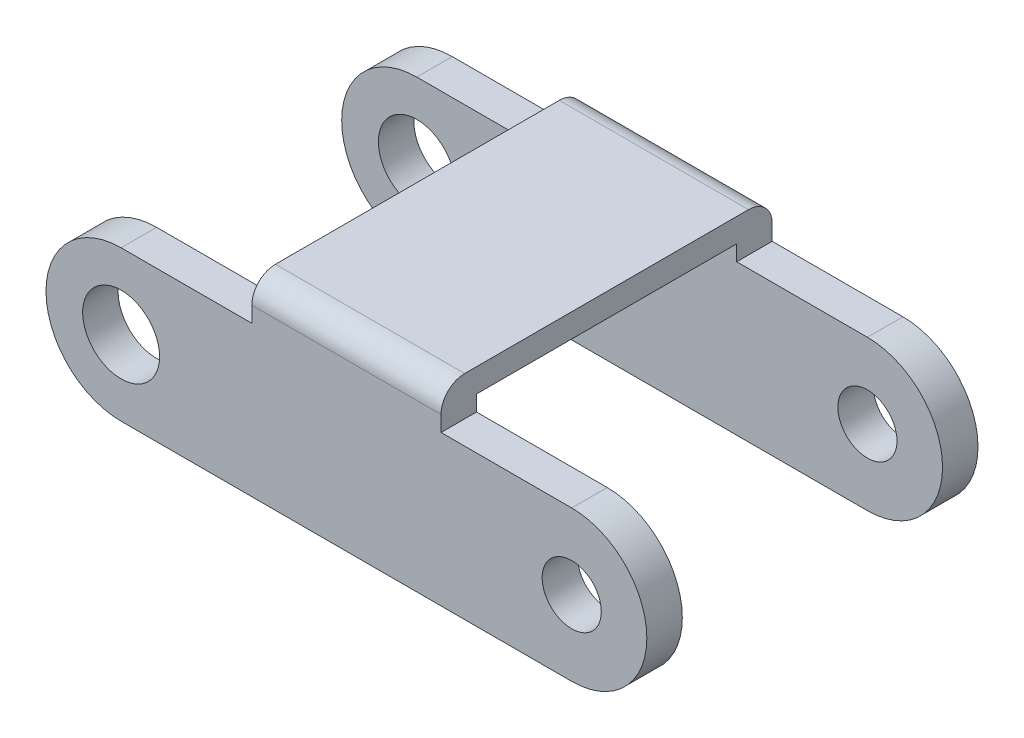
ISO-10303-21;
HEADER;
FILE_DESCRIPTION(('STEP AP214'),'2;1');
FILE_NAME('part.step','',(''),(''),'','','');
FILE_SCHEMA(('AUTOMOTIVE_DESIGN { 1 0 10303 214 1 1 1 1 }'));
ENDSEC;
DATA;
#1=APPLICATION_CONTEXT('core data for automotive mechanical design processes');
#2=APPLICATION_PROTOCOL_DEFINITION('international standard','automotive_design',2000,#1);
#3=PRODUCT_CONTEXT('',#1,'mechanical');
#4=PRODUCT('Part','Part','',(#3));
#5=PRODUCT_RELATED_PRODUCT_CATEGORY('part','',(#4));
#6=PRODUCT_DEFINITION_FORMATION('','',#4);
#7=PRODUCT_DEFINITION_CONTEXT('part definition',#1,'design');
#8=PRODUCT_DEFINITION('design','',#6,#7);
#9=PRODUCT_DEFINITION_SHAPE('','',#8);
#10=(LENGTH_UNIT() NAMED_UNIT(*) SI_UNIT(.MILLI.,.METRE.));
#11=(NAMED_UNIT(*) PLANE_ANGLE_UNIT() SI_UNIT($,.RADIAN.));
#12=(NAMED_UNIT(*) SI_UNIT($,.STERADIAN.) SOLID_ANGLE_UNIT());
#13=UNCERTAINTY_MEASURE_WITH_UNIT(LENGTH_MEASURE(1.E-05),#10,'distance_accuracy_value','');
#14=(GEOMETRIC_REPRESENTATION_CONTEXT(3) GLOBAL_UNCERTAINTY_ASSIGNED_CONTEXT((#13)) GLOBAL_UNIT_ASSIGNED_CONTEXT((#10,
#11,#12)) REPRESENTATION_CONTEXT('',''));
#15=CARTESIAN_POINT('',(0.,0.,0.));
#16=DIRECTION('',(0.,0.,1.));
#17=DIRECTION('',(1.,0.,0.));
#18=AXIS2_PLACEMENT_3D('',#15,#16,#17);
#19=CARTESIAN_POINT('',(-19.05,8.56225806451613,-3.));
#20=DIRECTION('',(0.,1.,0.));
#21=DIRECTION('',(0.,0.,1.));
#22=AXIS2_PLACEMENT_3D('',#19,#20,#21);
#23=PLANE('',#22);
#24=DIRECTION('',(-1.,0.,0.));
#25=VECTOR('',#24,1.);
#26=CARTESIAN_POINT('',(-19.05,8.56225806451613,-3.));
#27=LINE('',#26,#25);
#28=CARTESIAN_POINT('',(19.05,8.56225806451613,-3.));
#29=VERTEX_POINT('',#28);
#30=CARTESIAN_POINT('',(8.,8.56225806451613,-3.));
#31=VERTEX_POINT('',#30);
#32=EDGE_CURVE('E304',#29,#31,#27,.T.);
#33=ORIENTED_EDGE('',*,*,#32,.T.);
#34=DIRECTION('',(0.,0.,-1.));
#35=VECTOR('',#34,1.);
#36=CARTESIAN_POINT('',(8.,8.56225806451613,0.));
#37=LINE('',#36,#35);
#38=CARTESIAN_POINT('',(8.,8.56225806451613,0.));
#39=VERTEX_POINT('',#38);
#40=EDGE_CURVE('E249',#39,#31,#37,.T.);
#41=ORIENTED_EDGE('',*,*,#40,.F.);
#42=DIRECTION('',(-1.,0.,0.));
#43=VECTOR('',#42,1.);
#44=CARTESIAN_POINT('',(-19.05,8.56225806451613,0.));
#45=LINE('',#44,#43);
#46=CARTESIAN_POINT('',(19.05,8.56225806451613,0.));
#47=VERTEX_POINT('',#46);
#48=EDGE_CURVE('E299',#47,#39,#45,.T.);
#49=ORIENTED_EDGE('',*,*,#48,.F.);
#50=DIRECTION('',(0.,0.,1.));
#51=VECTOR('',#50,1.);
#52=CARTESIAN_POINT('',(19.05,8.56225806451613,-3.));
#53=LINE('',#52,#51);
#54=EDGE_CURVE('E41',#29,#47,#53,.T.);
#55=ORIENTED_EDGE('',*,*,#54,.F.);
#56=EDGE_LOOP('',(#33,#41,#49,#55));
#57=FACE_BOUND('',#56,.T.);
#58=ADVANCED_FACE('F32',(#57),#23,.T.);
#59=CARTESIAN_POINT('',(-19.05,2.21225806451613,-3.));
#60=DIRECTION('',(0.,0.,1.));
#61=DIRECTION('',(1.,0.,0.));
#62=AXIS2_PLACEMENT_3D('',#59,#60,#61);
#63=CYLINDRICAL_SURFACE('',#62,6.35);
#64=CARTESIAN_POINT('',(-19.05,2.21225806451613,0.));
#65=DIRECTION('',(0.,0.,1.));
#66=DIRECTION('',(1.,0.,0.));
#67=AXIS2_PLACEMENT_3D('',#64,#65,#66);
#68=CIRCLE('',#67,6.35);
#69=CARTESIAN_POINT('',(-19.05,8.56225806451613,0.));
#70=VERTEX_POINT('',#69);
#71=CARTESIAN_POINT('',(-19.05,-4.13774193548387,0.));
#72=VERTEX_POINT('',#71);
#73=EDGE_CURVE('E292',#70,#72,#68,.T.);
#74=ORIENTED_EDGE('',*,*,#73,.F.);
#75=DIRECTION('',(0.,0.,1.));
#76=VECTOR('',#75,1.);
#77=CARTESIAN_POINT('',(-19.05,8.56225806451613,-3.));
#78=LINE('',#77,#76);
#79=CARTESIAN_POINT('',(-19.05,8.56225806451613,-3.));
#80=VERTEX_POINT('',#79);
#81=EDGE_CURVE('E11',#80,#70,#78,.T.);
#82=ORIENTED_EDGE('',*,*,#81,.F.);
#83=CARTESIAN_POINT('',(-19.05,2.21225806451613,-3.));
#84=DIRECTION('',(0.,0.,1.));
#85=DIRECTION('',(1.,0.,0.));
#86=AXIS2_PLACEMENT_3D('',#83,#84,#85);
#87=CIRCLE('',#86,6.35);
#88=CARTESIAN_POINT('',(-19.05,-4.13774193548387,-3.));
#89=VERTEX_POINT('',#88);
#90=EDGE_CURVE('E295',#80,#89,#87,.T.);
#91=ORIENTED_EDGE('',*,*,#90,.T.);
#92=DIRECTION('',(0.,0.,1.));
#93=VECTOR('',#92,1.);
#94=CARTESIAN_POINT('',(-19.05,-4.13774193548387,-3.));
#95=LINE('',#94,#93);
#96=EDGE_CURVE('E36',#89,#72,#95,.T.);
#97=ORIENTED_EDGE('',*,*,#96,.T.);
#98=EDGE_LOOP('',(#74,#82,#91,#97));
#99=FACE_BOUND('',#98,.T.);
#100=ADVANCED_FACE('F34',(#99),#63,.T.);
#101=DIRECTION('',(0.,0.,-1.));
#102=VECTOR('',#101,1.);
#103=CARTESIAN_POINT('',(-8.,8.56225806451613,0.));
#104=LINE('',#103,#102);
#105=CARTESIAN_POINT('',(-8.,8.56225806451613,0.));
#106=VERTEX_POINT('',#105);
#107=CARTESIAN_POINT('',(-8.,8.56225806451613,-3.));
#108=VERTEX_POINT('',#107);
#109=EDGE_CURVE('E49',#106,#108,#104,.T.);
#110=ORIENTED_EDGE('',*,*,#109,.T.);
#111=EDGE_CURVE('E56',#108,#80,#27,.T.);
#112=ORIENTED_EDGE('',*,*,#111,.T.);
#113=ORIENTED_EDGE('',*,*,#81,.T.);
#114=EDGE_CURVE('E78',#106,#70,#45,.T.);
#115=ORIENTED_EDGE('',*,*,#114,.F.);
#116=EDGE_LOOP('',(#110,#112,#113,#115));
#117=FACE_BOUND('',#116,.T.);
#118=ADVANCED_FACE('F342',(#117),#23,.T.);
#119=CARTESIAN_POINT('',(19.05,2.21225806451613,-3.));
#120=DIRECTION('',(0.,0.,1.));
#121=DIRECTION('',(1.,0.,0.));
#122=AXIS2_PLACEMENT_3D('',#119,#120,#121);
#123=CYLINDRICAL_SURFACE('',#122,6.35);
#124=CARTESIAN_POINT('',(19.05,2.21225806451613,0.));
#125=DIRECTION('',(0.,0.,1.));
#126=DIRECTION('',(-1.,0.,0.));
#127=AXIS2_PLACEMENT_3D('',#124,#125,#126);
#128=CIRCLE('',#127,6.35);
#129=CARTESIAN_POINT('',(19.05,-4.13774193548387,0.));
#130=VERTEX_POINT('',#129);
#131=EDGE_CURVE('E311',#130,#47,#128,.T.);
#132=ORIENTED_EDGE('',*,*,#131,.F.);
#133=DIRECTION('',(0.,0.,1.));
#134=VECTOR('',#133,1.);
#135=CARTESIAN_POINT('',(19.05,-4.13774193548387,-3.));
#136=LINE('',#135,#134);
#137=CARTESIAN_POINT('',(19.05,-4.13774193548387,-3.));
#138=VERTEX_POINT('',#137);
#139=EDGE_CURVE('E316',#138,#130,#136,.T.);
#140=ORIENTED_EDGE('',*,*,#139,.F.);
#141=CARTESIAN_POINT('',(19.05,2.21225806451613,-3.));
#142=DIRECTION('',(0.,0.,1.));
#143=DIRECTION('',(-1.,0.,0.));
#144=AXIS2_PLACEMENT_3D('',#141,#142,#143);
#145=CIRCLE('',#144,6.35);
#146=EDGE_CURVE('E301',#138,#29,#145,.T.);
#147=ORIENTED_EDGE('',*,*,#146,.T.);
#148=ORIENTED_EDGE('',*,*,#54,.T.);
#149=EDGE_LOOP('',(#132,#140,#147,#148));
#150=FACE_BOUND('',#149,.T.);
#151=ADVANCED_FACE('F348',(#150),#123,.T.);
#152=CARTESIAN_POINT('',(-19.05,-4.13774193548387,-3.));
#153=DIRECTION('',(0.,-1.,0.));
#154=DIRECTION('',(0.,0.,-1.));
#155=AXIS2_PLACEMENT_3D('',#152,#153,#154);
#156=PLANE('',#155);
#157=DIRECTION('',(1.,0.,0.));
#158=VECTOR('',#157,1.);
#159=CARTESIAN_POINT('',(-19.05,-4.13774193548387,0.));
#160=LINE('',#159,#158);
#161=EDGE_CURVE('E308',#72,#130,#160,.T.);
#162=ORIENTED_EDGE('',*,*,#161,.F.);
#163=ORIENTED_EDGE('',*,*,#96,.F.);
#164=DIRECTION('',(1.,0.,0.));
#165=VECTOR('',#164,1.);
#166=CARTESIAN_POINT('',(-19.05,-4.13774193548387,-3.));
#167=LINE('',#166,#165);
#168=EDGE_CURVE('E298',#89,#138,#167,.T.);
#169=ORIENTED_EDGE('',*,*,#168,.T.);
#170=ORIENTED_EDGE('',*,*,#139,.T.);
#171=EDGE_LOOP('',(#162,#163,#169,#170));
#172=FACE_BOUND('',#171,.T.);
#173=ADVANCED_FACE('F321',(#172),#156,.T.);
#174=CARTESIAN_POINT('',(-19.05,2.21225806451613,-3.));
#175=DIRECTION('',(0.,0.,1.));
#176=DIRECTION('',(1.,0.,0.));
#177=AXIS2_PLACEMENT_3D('',#174,#175,#176);
#178=PLANE('',#177);
#179=CARTESIAN_POINT('',(-19.05,2.21225806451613,-3.));
#180=DIRECTION('',(0.,0.,1.));
#181=DIRECTION('',(1.,0.,0.));
#182=AXIS2_PLACEMENT_3D('',#179,#180,#181);
#183=CIRCLE('',#182,3.25);
#184=CARTESIAN_POINT('',(-15.8,2.21225806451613,-3.));
#185=VERTEX_POINT('',#184);
#186=EDGE_CURVE('E283',#185,#185,#183,.T.);
#187=ORIENTED_EDGE('',*,*,#186,.T.);
#188=EDGE_LOOP('',(#187));
#189=FACE_BOUND('',#188,.T.);
#190=CARTESIAN_POINT('',(19.05,2.21225806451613,-3.));
#191=DIRECTION('',(0.,0.,1.));
#192=DIRECTION('',(1.,0.,0.));
#193=AXIS2_PLACEMENT_3D('',#190,#191,#192);
#194=CIRCLE('',#193,2.5);
#195=CARTESIAN_POINT('',(21.55,2.21225806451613,-3.));
#196=VERTEX_POINT('',#195);
#197=EDGE_CURVE('E289',#196,#196,#194,.T.);
#198=ORIENTED_EDGE('',*,*,#197,.T.);
#199=EDGE_LOOP('',(#198));
#200=FACE_BOUND('',#199,.T.);
#201=ORIENTED_EDGE('',*,*,#90,.F.);
#202=ORIENTED_EDGE('',*,*,#111,.F.);
#203=DIRECTION('',(0.,1.,0.));
#204=VECTOR('',#203,1.);
#205=CARTESIAN_POINT('',(-8.,8.56225806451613,-3.));
#206=LINE('',#205,#204);
#207=CARTESIAN_POINT('',(-8.,9.88225806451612,-3.));
#208=VERTEX_POINT('',#207);
#209=EDGE_CURVE('E265',#108,#208,#206,.T.);
#210=ORIENTED_EDGE('',*,*,#209,.T.);
#211=DIRECTION('',(-1.,0.,0.));
#212=VECTOR('',#211,1.);
#213=CARTESIAN_POINT('',(8.,9.88225806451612,-3.));
#214=LINE('',#213,#212);
#215=CARTESIAN_POINT('',(8.,9.88225806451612,-3.));
#216=VERTEX_POINT('',#215);
#217=EDGE_CURVE('E279',#216,#208,#214,.T.);
#218=ORIENTED_EDGE('',*,*,#217,.F.);
#219=DIRECTION('',(0.,1.,0.));
#220=VECTOR('',#219,1.);
#221=CARTESIAN_POINT('',(8.,8.56225806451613,-3.));
#222=LINE('',#221,#220);
#223=EDGE_CURVE('E252',#31,#216,#222,.T.);
#224=ORIENTED_EDGE('',*,*,#223,.F.);
#225=ORIENTED_EDGE('',*,*,#32,.F.);
#226=ORIENTED_EDGE('',*,*,#146,.F.);
#227=ORIENTED_EDGE('',*,*,#168,.F.);
#228=EDGE_LOOP('',(#201,#202,#210,#218,#224,#225,#226,#227));
#229=FACE_BOUND('',#228,.T.);
#230=ADVANCED_FACE('F325',(#189,#200,#229),#178,.F.);
#231=CARTESIAN_POINT('',(-19.05,2.21225806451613,0.));
#232=DIRECTION('',(0.,0.,1.));
#233=DIRECTION('',(1.,0.,0.));
#234=AXIS2_PLACEMENT_3D('',#231,#232,#233);
#235=PLANE('',#234);
#236=CARTESIAN_POINT('',(-19.05,2.21225806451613,0.));
#237=DIRECTION('',(0.,0.,1.));
#238=DIRECTION('',(1.,0.,0.));
#239=AXIS2_PLACEMENT_3D('',#236,#237,#238);
#240=CIRCLE('',#239,3.25);
#241=CARTESIAN_POINT('',(-15.8,2.21225806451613,0.));
#242=VERTEX_POINT('',#241);
#243=EDGE_CURVE('E282',#242,#242,#240,.T.);
#244=ORIENTED_EDGE('',*,*,#243,.F.);
#245=EDGE_LOOP('',(#244));
#246=FACE_BOUND('',#245,.T.);
#247=CARTESIAN_POINT('',(19.05,2.21225806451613,0.));
#248=DIRECTION('',(0.,0.,1.));
#249=DIRECTION('',(1.,0.,0.));
#250=AXIS2_PLACEMENT_3D('',#247,#248,#249);
#251=CIRCLE('',#250,2.5);
#252=CARTESIAN_POINT('',(21.55,2.21225806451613,0.));
#253=VERTEX_POINT('',#252);
#254=EDGE_CURVE('E286',#253,#253,#251,.T.);
#255=ORIENTED_EDGE('',*,*,#254,.F.);
#256=EDGE_LOOP('',(#255));
#257=FACE_BOUND('',#256,.T.);
#258=ORIENTED_EDGE('',*,*,#73,.T.);
#259=ORIENTED_EDGE('',*,*,#161,.T.);
#260=ORIENTED_EDGE('',*,*,#131,.T.);
#261=ORIENTED_EDGE('',*,*,#48,.T.);
#262=DIRECTION('',(0.,-1.,0.));
#263=VECTOR('',#262,1.);
#264=CARTESIAN_POINT('',(8.,9.88225806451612,0.));
#265=LINE('',#264,#263);
#266=CARTESIAN_POINT('',(8.,9.88225806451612,0.));
#267=VERTEX_POINT('',#266);
#268=EDGE_CURVE('E261',#267,#39,#265,.T.);
#269=ORIENTED_EDGE('',*,*,#268,.F.);
#270=DIRECTION('',(-1.,0.,0.));
#271=VECTOR('',#270,1.);
#272=CARTESIAN_POINT('',(8.,9.88225806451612,0.));
#273=LINE('',#272,#271);
#274=CARTESIAN_POINT('',(-8.,9.88225806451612,0.));
#275=VERTEX_POINT('',#274);
#276=EDGE_CURVE('E263',#267,#275,#273,.T.);
#277=ORIENTED_EDGE('',*,*,#276,.T.);
#278=DIRECTION('',(0.,-1.,0.));
#279=VECTOR('',#278,1.);
#280=CARTESIAN_POINT('',(-8.,9.88225806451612,0.));
#281=LINE('',#280,#279);
#282=EDGE_CURVE('E253',#275,#106,#281,.T.);
#283=ORIENTED_EDGE('',*,*,#282,.T.);
#284=ORIENTED_EDGE('',*,*,#114,.T.);
#285=EDGE_LOOP('',(#258,#259,#260,#261,#269,#277,#283,#284));
#286=FACE_BOUND('',#285,.T.);
#287=ADVANCED_FACE('F322',(#246,#257,#286),#235,.T.);
#288=CARTESIAN_POINT('',(19.05,2.21225806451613,-3.));
#289=DIRECTION('',(0.,0.,1.));
#290=DIRECTION('',(1.,0.,0.));
#291=AXIS2_PLACEMENT_3D('',#288,#289,#290);
#292=CYLINDRICAL_SURFACE('',#291,2.5);
#293=ORIENTED_EDGE('',*,*,#197,.F.);
#294=EDGE_LOOP('',(#293));
#295=FACE_BOUND('',#294,.T.);
#296=ORIENTED_EDGE('',*,*,#254,.T.);
#297=EDGE_LOOP('',(#296));
#298=FACE_BOUND('',#297,.T.);
#299=ADVANCED_FACE('F324',(#295,#298),#292,.F.);
#300=CARTESIAN_POINT('',(-19.05,2.21225806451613,-3.));
#301=DIRECTION('',(0.,0.,1.));
#302=DIRECTION('',(1.,0.,0.));
#303=AXIS2_PLACEMENT_3D('',#300,#301,#302);
#304=CYLINDRICAL_SURFACE('',#303,3.25);
#305=ORIENTED_EDGE('',*,*,#186,.F.);
#306=EDGE_LOOP('',(#305));
#307=FACE_BOUND('',#306,.T.);
#308=ORIENTED_EDGE('',*,*,#243,.T.);
#309=EDGE_LOOP('',(#308));
#310=FACE_BOUND('',#309,.T.);
#311=ADVANCED_FACE('F332',(#307,#310),#304,.F.);
#312=CARTESIAN_POINT('',(8.,9.88225806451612,-3.));
#313=DIRECTION('',(0.,1.,0.));
#314=DIRECTION('',(0.,0.,1.));
#315=AXIS2_PLACEMENT_3D('',#312,#313,#314);
#316=PLANE('',#315);
#317=DIRECTION('',(0.,0.,-1.));
#318=VECTOR('',#317,1.);
#319=CARTESIAN_POINT('',(-8.,9.88225806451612,-3.));
#320=LINE('',#319,#318);
#321=CARTESIAN_POINT('',(-8.,9.88225806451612,-25.));
#322=VERTEX_POINT('',#321);
#323=EDGE_CURVE('E267',#208,#322,#320,.T.);
#324=ORIENTED_EDGE('',*,*,#323,.T.);
#325=DIRECTION('',(-1.,0.,0.));
#326=VECTOR('',#325,1.);
#327=CARTESIAN_POINT('',(8.,9.88225806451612,-25.));
#328=LINE('',#327,#326);
#329=CARTESIAN_POINT('',(8.,9.88225806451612,-25.));
#330=VERTEX_POINT('',#329);
#331=EDGE_CURVE('E235',#330,#322,#328,.T.);
#332=ORIENTED_EDGE('',*,*,#331,.F.);
#333=DIRECTION('',(0.,0.,-1.));
#334=VECTOR('',#333,1.);
#335=CARTESIAN_POINT('',(8.,9.88225806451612,-3.));
#336=LINE('',#335,#334);
#337=EDGE_CURVE('E255',#216,#330,#336,.T.);
#338=ORIENTED_EDGE('',*,*,#337,.F.);
#339=ORIENTED_EDGE('',*,*,#217,.T.);
#340=EDGE_LOOP('',(#324,#332,#338,#339));
#341=FACE_BOUND('',#340,.T.);
#342=ADVANCED_FACE('F397',(#341),#316,.F.);
#343=CARTESIAN_POINT('',(8.,11.8822580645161,-14.));
#344=DIRECTION('',(0.,-1.,0.));
#345=DIRECTION('',(0.,0.,-1.));
#346=AXIS2_PLACEMENT_3D('',#343,#344,#345);
#347=PLANE('',#346);
#348=DIRECTION('',(0.,0.,1.));
#349=VECTOR('',#348,1.);
#350=CARTESIAN_POINT('',(-8.,11.8822580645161,-14.));
#351=LINE('',#350,#349);
#352=CARTESIAN_POINT('',(-8.,11.8822580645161,-26.));
#353=VERTEX_POINT('',#352);
#354=CARTESIAN_POINT('',(-8.,11.8822580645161,-2.));
#355=VERTEX_POINT('',#354);
#356=EDGE_CURVE('E269',#353,#355,#351,.T.);
#357=ORIENTED_EDGE('',*,*,#356,.T.);
#358=DIRECTION('',(-1.,0.,0.));
#359=VECTOR('',#358,1.);
#360=CARTESIAN_POINT('',(8.,11.8822580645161,-2.));
#361=LINE('',#360,#359);
#362=CARTESIAN_POINT('',(8.,11.8822580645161,-2.));
#363=VERTEX_POINT('',#362);
#364=EDGE_CURVE('E276',#363,#355,#361,.T.);
#365=ORIENTED_EDGE('',*,*,#364,.F.);
#366=DIRECTION('',(0.,0.,1.));
#367=VECTOR('',#366,1.);
#368=CARTESIAN_POINT('',(8.,11.8822580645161,-14.));
#369=LINE('',#368,#367);
#370=CARTESIAN_POINT('',(8.,11.8822580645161,-26.));
#371=VERTEX_POINT('',#370);
#372=EDGE_CURVE('E257',#371,#363,#369,.T.);
#373=ORIENTED_EDGE('',*,*,#372,.F.);
#374=DIRECTION('',(-1.,0.,0.));
#375=VECTOR('',#374,1.);
#376=CARTESIAN_POINT('',(8.,11.8822580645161,-26.));
#377=LINE('',#376,#375);
#378=EDGE_CURVE('E244',#371,#353,#377,.T.);
#379=ORIENTED_EDGE('',*,*,#378,.T.);
#380=EDGE_LOOP('',(#357,#365,#373,#379));
#381=FACE_BOUND('',#380,.T.);
#382=ADVANCED_FACE('F370',(#381),#347,.F.);
#383=CARTESIAN_POINT('',(8.,9.88225806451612,-2.));
#384=DIRECTION('',(-1.,0.,0.));
#385=DIRECTION('',(0.,0.,1.));
#386=AXIS2_PLACEMENT_3D('',#383,#384,#385);
#387=CYLINDRICAL_SURFACE('',#386,2.);
#388=CARTESIAN_POINT('',(-8.,9.88225806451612,-2.));
#389=DIRECTION('',(1.,0.,0.));
#390=DIRECTION('',(0.,0.,1.));
#391=AXIS2_PLACEMENT_3D('',#388,#389,#390);
#392=CIRCLE('',#391,2.);
#393=EDGE_CURVE('E271',#355,#275,#392,.T.);
#394=ORIENTED_EDGE('',*,*,#393,.T.);
#395=ORIENTED_EDGE('',*,*,#276,.F.);
#396=CARTESIAN_POINT('',(8.,9.88225806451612,-2.));
#397=DIRECTION('',(1.,0.,0.));
#398=DIRECTION('',(0.,0.,1.));
#399=AXIS2_PLACEMENT_3D('',#396,#397,#398);
#400=CIRCLE('',#399,2.);
#401=EDGE_CURVE('E259',#363,#267,#400,.T.);
#402=ORIENTED_EDGE('',*,*,#401,.F.);
#403=ORIENTED_EDGE('',*,*,#364,.T.);
#404=EDGE_LOOP('',(#394,#395,#402,#403));
#405=FACE_BOUND('',#404,.T.);
#406=ADVANCED_FACE('F367',(#405),#387,.T.);
#407=CARTESIAN_POINT('',(8.,9.88225806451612,-2.));
#408=DIRECTION('',(-1.,0.,0.));
#409=DIRECTION('',(0.,0.,1.));
#410=AXIS2_PLACEMENT_3D('',#407,#408,#409);
#411=PLANE('',#410);
#412=ORIENTED_EDGE('',*,*,#40,.T.);
#413=ORIENTED_EDGE('',*,*,#223,.T.);
#414=ORIENTED_EDGE('',*,*,#337,.T.);
#415=DIRECTION('',(0.,1.,0.));
#416=VECTOR('',#415,1.);
#417=CARTESIAN_POINT('',(8.,8.56225806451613,-25.));
#418=LINE('',#417,#416);
#419=CARTESIAN_POINT('',(8.,8.56225806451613,-25.));
#420=VERTEX_POINT('',#419);
#421=EDGE_CURVE('E232',#420,#330,#418,.T.);
#422=ORIENTED_EDGE('',*,*,#421,.F.);
#423=DIRECTION('',(0.,0.,1.));
#424=VECTOR('',#423,1.);
#425=CARTESIAN_POINT('',(8.,8.56225806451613,-28.));
#426=LINE('',#425,#424);
#427=CARTESIAN_POINT('',(8.,8.56225806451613,-28.));
#428=VERTEX_POINT('',#427);
#429=EDGE_CURVE('E223',#428,#420,#426,.T.);
#430=ORIENTED_EDGE('',*,*,#429,.F.);
#431=DIRECTION('',(0.,-1.,0.));
#432=VECTOR('',#431,1.);
#433=CARTESIAN_POINT('',(8.,9.88225806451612,-28.));
#434=LINE('',#433,#432);
#435=CARTESIAN_POINT('',(8.,9.88225806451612,-28.));
#436=VERTEX_POINT('',#435);
#437=EDGE_CURVE('E226',#436,#428,#434,.T.);
#438=ORIENTED_EDGE('',*,*,#437,.F.);
#439=CARTESIAN_POINT('',(8.,9.88225806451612,-26.));
#440=DIRECTION('',(-1.,0.,0.));
#441=DIRECTION('',(0.,0.,-1.));
#442=AXIS2_PLACEMENT_3D('',#439,#440,#441);
#443=CIRCLE('',#442,2.);
#444=EDGE_CURVE('E229',#371,#436,#443,.T.);
#445=ORIENTED_EDGE('',*,*,#444,.F.);
#446=ORIENTED_EDGE('',*,*,#372,.T.);
#447=ORIENTED_EDGE('',*,*,#401,.T.);
#448=ORIENTED_EDGE('',*,*,#268,.T.);
#449=EDGE_LOOP('',(#412,#413,#414,#422,#430,#438,#445,#446,#447,#448));
#450=FACE_BOUND('',#449,.T.);
#451=ADVANCED_FACE('F361',(#450),#411,.F.);
#452=CARTESIAN_POINT('',(-8.,9.88225806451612,-2.));
#453=DIRECTION('',(-1.,0.,0.));
#454=DIRECTION('',(0.,0.,1.));
#455=AXIS2_PLACEMENT_3D('',#452,#453,#454);
#456=PLANE('',#455);
#457=ORIENTED_EDGE('',*,*,#109,.F.);
#458=ORIENTED_EDGE('',*,*,#282,.F.);
#459=ORIENTED_EDGE('',*,*,#393,.F.);
#460=ORIENTED_EDGE('',*,*,#356,.F.);
#461=CARTESIAN_POINT('',(-8.,9.88225806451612,-26.));
#462=DIRECTION('',(-1.,0.,0.));
#463=DIRECTION('',(0.,0.,-1.));
#464=AXIS2_PLACEMENT_3D('',#461,#462,#463);
#465=CIRCLE('',#464,2.);
#466=CARTESIAN_POINT('',(-8.,9.88225806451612,-28.));
#467=VERTEX_POINT('',#466);
#468=EDGE_CURVE('E239',#353,#467,#465,.T.);
#469=ORIENTED_EDGE('',*,*,#468,.T.);
#470=DIRECTION('',(0.,-1.,0.));
#471=VECTOR('',#470,1.);
#472=CARTESIAN_POINT('',(-8.,9.88225806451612,-28.));
#473=LINE('',#472,#471);
#474=CARTESIAN_POINT('',(-8.,8.56225806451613,-28.));
#475=VERTEX_POINT('',#474);
#476=EDGE_CURVE('E237',#467,#475,#473,.T.);
#477=ORIENTED_EDGE('',*,*,#476,.T.);
#478=DIRECTION('',(0.,0.,1.));
#479=VECTOR('',#478,1.);
#480=CARTESIAN_POINT('',(-8.,8.56225806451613,-28.));
#481=LINE('',#480,#479);
#482=CARTESIAN_POINT('',(-8.,8.56225806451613,-25.));
#483=VERTEX_POINT('',#482);
#484=EDGE_CURVE('E217',#475,#483,#481,.T.);
#485=ORIENTED_EDGE('',*,*,#484,.T.);
#486=DIRECTION('',(0.,1.,0.));
#487=VECTOR('',#486,1.);
#488=CARTESIAN_POINT('',(-8.,8.56225806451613,-25.));
#489=LINE('',#488,#487);
#490=EDGE_CURVE('E177',#483,#322,#489,.T.);
#491=ORIENTED_EDGE('',*,*,#490,.T.);
#492=ORIENTED_EDGE('',*,*,#323,.F.);
#493=ORIENTED_EDGE('',*,*,#209,.F.);
#494=EDGE_LOOP('',(#457,#458,#459,#460,#469,#477,#485,#491,#492,#493));
#495=FACE_BOUND('',#494,.T.);
#496=ADVANCED_FACE('F366',(#495),#456,.T.);
#497=CARTESIAN_POINT('',(8.,9.88225806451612,-28.));
#498=DIRECTION('',(0.,0.,-1.));
#499=DIRECTION('',(0.,1.,0.));
#500=AXIS2_PLACEMENT_3D('',#497,#498,#499);
#501=PLANE('',#500);
#502=ORIENTED_EDGE('',*,*,#476,.F.);
#503=DIRECTION('',(-1.,0.,0.));
#504=VECTOR('',#503,1.);
#505=CARTESIAN_POINT('',(8.,9.88225806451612,-28.));
#506=LINE('',#505,#504);
#507=EDGE_CURVE('E247',#436,#467,#506,.T.);
#508=ORIENTED_EDGE('',*,*,#507,.F.);
#509=ORIENTED_EDGE('',*,*,#437,.T.);
#510=DIRECTION('',(-1.,0.,0.));
#511=VECTOR('',#510,1.);
#512=CARTESIAN_POINT('',(-19.05,8.56225806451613,-28.));
#513=LINE('',#512,#511);
#514=CARTESIAN_POINT('',(19.05,8.56225806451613,-28.));
#515=VERTEX_POINT('',#514);
#516=EDGE_CURVE('E212',#515,#428,#513,.T.);
#517=ORIENTED_EDGE('',*,*,#516,.F.);
#518=CARTESIAN_POINT('',(19.05,2.21225806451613,-28.));
#519=DIRECTION('',(0.,0.,1.));
#520=DIRECTION('',(-1.,0.,0.));
#521=AXIS2_PLACEMENT_3D('',#518,#519,#520);
#522=CIRCLE('',#521,6.35);
#523=CARTESIAN_POINT('',(19.05,-4.13774193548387,-28.));
#524=VERTEX_POINT('',#523);
#525=EDGE_CURVE('E199',#524,#515,#522,.T.);
#526=ORIENTED_EDGE('',*,*,#525,.F.);
#527=DIRECTION('',(1.,0.,0.));
#528=VECTOR('',#527,1.);
#529=CARTESIAN_POINT('',(-19.05,-4.13774193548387,-28.));
#530=LINE('',#529,#528);
#531=CARTESIAN_POINT('',(-19.05,-4.13774193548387,-28.));
#532=VERTEX_POINT('',#531);
#533=EDGE_CURVE('E197',#532,#524,#530,.T.);
#534=ORIENTED_EDGE('',*,*,#533,.F.);
#535=CARTESIAN_POINT('',(-19.05,2.21225806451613,-28.));
#536=DIRECTION('',(0.,0.,1.));
#537=DIRECTION('',(1.,0.,0.));
#538=AXIS2_PLACEMENT_3D('',#535,#536,#537);
#539=CIRCLE('',#538,6.35);
#540=CARTESIAN_POINT('',(-19.05,8.56225806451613,-28.));
#541=VERTEX_POINT('',#540);
#542=EDGE_CURVE('E209',#541,#532,#539,.T.);
#543=ORIENTED_EDGE('',*,*,#542,.F.);
#544=EDGE_CURVE('E187',#475,#541,#513,.T.);
#545=ORIENTED_EDGE('',*,*,#544,.F.);
#546=EDGE_LOOP('',(#502,#508,#509,#517,#526,#534,#543,#545));
#547=FACE_BOUND('',#546,.T.);
#548=CARTESIAN_POINT('',(19.05,2.21225806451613,-28.));
#549=DIRECTION('',(0.,0.,1.));
#550=DIRECTION('',(1.,0.,0.));
#551=AXIS2_PLACEMENT_3D('',#548,#549,#550);
#552=CIRCLE('',#551,2.5);
#553=CARTESIAN_POINT('',(21.55,2.21225806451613,-28.));
#554=VERTEX_POINT('',#553);
#555=EDGE_CURVE('E202',#554,#554,#552,.T.);
#556=ORIENTED_EDGE('',*,*,#555,.T.);
#557=EDGE_LOOP('',(#556));
#558=FACE_BOUND('',#557,.T.);
#559=CARTESIAN_POINT('',(-19.05,2.21225806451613,-28.));
#560=DIRECTION('',(0.,0.,1.));
#561=DIRECTION('',(1.,0.,0.));
#562=AXIS2_PLACEMENT_3D('',#559,#560,#561);
#563=CIRCLE('',#562,3.25);
#564=CARTESIAN_POINT('',(-15.8,2.21225806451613,-28.));
#565=VERTEX_POINT('',#564);
#566=EDGE_CURVE('E443',#565,#565,#563,.T.);
#567=ORIENTED_EDGE('',*,*,#566,.T.);
#568=EDGE_LOOP('',(#567));
#569=FACE_BOUND('',#568,.T.);
#570=ADVANCED_FACE('F378',(#547,#558,#569),#501,.T.);
#571=CARTESIAN_POINT('',(8.,9.88225806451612,-26.));
#572=DIRECTION('',(-1.,0.,0.));
#573=DIRECTION('',(0.,0.,1.));
#574=AXIS2_PLACEMENT_3D('',#571,#572,#573);
#575=CYLINDRICAL_SURFACE('',#574,2.);
#576=ORIENTED_EDGE('',*,*,#468,.F.);
#577=ORIENTED_EDGE('',*,*,#378,.F.);
#578=ORIENTED_EDGE('',*,*,#444,.T.);
#579=ORIENTED_EDGE('',*,*,#507,.T.);
#580=EDGE_LOOP('',(#576,#577,#578,#579));
#581=FACE_BOUND('',#580,.T.);
#582=ADVANCED_FACE('F375',(#581),#575,.T.);
#583=CARTESIAN_POINT('',(8.,8.56225806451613,-25.));
#584=DIRECTION('',(0.,0.,1.));
#585=DIRECTION('',(1.,0.,0.));
#586=AXIS2_PLACEMENT_3D('',#583,#584,#585);
#587=PLANE('',#586);
#588=ORIENTED_EDGE('',*,*,#490,.F.);
#589=DIRECTION('',(-1.,0.,0.));
#590=VECTOR('',#589,1.);
#591=CARTESIAN_POINT('',(-19.05,8.56225806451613,-25.));
#592=LINE('',#591,#590);
#593=CARTESIAN_POINT('',(-19.05,8.56225806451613,-25.));
#594=VERTEX_POINT('',#593);
#595=EDGE_CURVE('E168',#483,#594,#592,.T.);
#596=ORIENTED_EDGE('',*,*,#595,.T.);
#597=CARTESIAN_POINT('',(-19.05,2.21225806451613,-25.));
#598=DIRECTION('',(0.,0.,1.));
#599=DIRECTION('',(1.,0.,0.));
#600=AXIS2_PLACEMENT_3D('',#597,#598,#599);
#601=CIRCLE('',#600,6.35);
#602=CARTESIAN_POINT('',(-19.05,-4.13774193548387,-25.));
#603=VERTEX_POINT('',#602);
#604=EDGE_CURVE('E173',#594,#603,#601,.T.);
#605=ORIENTED_EDGE('',*,*,#604,.T.);
#606=DIRECTION('',(1.,0.,0.));
#607=VECTOR('',#606,1.);
#608=CARTESIAN_POINT('',(-19.05,-4.13774193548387,-25.));
#609=LINE('',#608,#607);
#610=CARTESIAN_POINT('',(19.05,-4.13774193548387,-25.));
#611=VERTEX_POINT('',#610);
#612=EDGE_CURVE('E192',#603,#611,#609,.T.);
#613=ORIENTED_EDGE('',*,*,#612,.T.);
#614=CARTESIAN_POINT('',(19.05,2.21225806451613,-25.));
#615=DIRECTION('',(0.,0.,1.));
#616=DIRECTION('',(-1.,0.,0.));
#617=AXIS2_PLACEMENT_3D('',#614,#615,#616);
#618=CIRCLE('',#617,6.35);
#619=CARTESIAN_POINT('',(19.05,8.56225806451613,-25.));
#620=VERTEX_POINT('',#619);
#621=EDGE_CURVE('E206',#611,#620,#618,.T.);
#622=ORIENTED_EDGE('',*,*,#621,.T.);
#623=EDGE_CURVE('E181',#620,#420,#592,.T.);
#624=ORIENTED_EDGE('',*,*,#623,.T.);
#625=ORIENTED_EDGE('',*,*,#421,.T.);
#626=ORIENTED_EDGE('',*,*,#331,.T.);
#627=EDGE_LOOP('',(#588,#596,#605,#613,#622,#624,#625,#626));
#628=FACE_BOUND('',#627,.T.);
#629=CARTESIAN_POINT('',(19.05,2.21225806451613,-25.));
#630=DIRECTION('',(0.,0.,1.));
#631=DIRECTION('',(1.,0.,0.));
#632=AXIS2_PLACEMENT_3D('',#629,#630,#631);
#633=CIRCLE('',#632,2.5);
#634=CARTESIAN_POINT('',(21.55,2.21225806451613,-25.));
#635=VERTEX_POINT('',#634);
#636=EDGE_CURVE('E211',#635,#635,#633,.T.);
#637=ORIENTED_EDGE('',*,*,#636,.F.);
#638=EDGE_LOOP('',(#637));
#639=FACE_BOUND('',#638,.T.);
#640=CARTESIAN_POINT('',(-19.05,2.21225806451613,-25.));
#641=DIRECTION('',(0.,0.,1.));
#642=DIRECTION('',(1.,0.,0.));
#643=AXIS2_PLACEMENT_3D('',#640,#641,#642);
#644=CIRCLE('',#643,3.25);
#645=CARTESIAN_POINT('',(-15.8,2.21225806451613,-25.));
#646=VERTEX_POINT('',#645);
#647=EDGE_CURVE('E440',#646,#646,#644,.T.);
#648=ORIENTED_EDGE('',*,*,#647,.F.);
#649=EDGE_LOOP('',(#648));
#650=FACE_BOUND('',#649,.T.);
#651=ADVANCED_FACE('F170',(#628,#639,#650),#587,.T.);
#652=CARTESIAN_POINT('',(-19.05,8.56225806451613,-25.));
#653=DIRECTION('',(0.,-1.,0.));
#654=DIRECTION('',(0.,0.,-1.));
#655=AXIS2_PLACEMENT_3D('',#652,#653,#654);
#656=PLANE('',#655);
#657=ORIENTED_EDGE('',*,*,#516,.T.);
#658=ORIENTED_EDGE('',*,*,#429,.T.);
#659=ORIENTED_EDGE('',*,*,#623,.F.);
#660=DIRECTION('',(0.,0.,-1.));
#661=VECTOR('',#660,1.);
#662=CARTESIAN_POINT('',(19.05,8.56225806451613,-25.));
#663=LINE('',#662,#661);
#664=EDGE_CURVE('E191',#620,#515,#663,.T.);
#665=ORIENTED_EDGE('',*,*,#664,.T.);
#666=EDGE_LOOP('',(#657,#658,#659,#665));
#667=FACE_BOUND('',#666,.T.);
#668=ADVANCED_FACE('F391',(#667),#656,.F.);
#669=CARTESIAN_POINT('',(-19.05,2.21225806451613,-25.));
#670=DIRECTION('',(0.,0.,-1.));
#671=DIRECTION('',(-1.,0.,0.));
#672=AXIS2_PLACEMENT_3D('',#669,#670,#671);
#673=CYLINDRICAL_SURFACE('',#672,6.35);
#674=ORIENTED_EDGE('',*,*,#542,.T.);
#675=DIRECTION('',(0.,0.,-1.));
#676=VECTOR('',#675,1.);
#677=CARTESIAN_POINT('',(-19.05,-4.13774193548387,-25.));
#678=LINE('',#677,#676);
#679=EDGE_CURVE('E196',#603,#532,#678,.T.);
#680=ORIENTED_EDGE('',*,*,#679,.F.);
#681=ORIENTED_EDGE('',*,*,#604,.F.);
#682=DIRECTION('',(0.,0.,-1.));
#683=VECTOR('',#682,1.);
#684=CARTESIAN_POINT('',(-19.05,8.56225806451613,-25.));
#685=LINE('',#684,#683);
#686=EDGE_CURVE('E184',#594,#541,#685,.T.);
#687=ORIENTED_EDGE('',*,*,#686,.T.);
#688=EDGE_LOOP('',(#674,#680,#681,#687));
#689=FACE_BOUND('',#688,.T.);
#690=ADVANCED_FACE('F194',(#689),#673,.T.);
#691=CARTESIAN_POINT('',(-19.05,-4.13774193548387,-25.));
#692=DIRECTION('',(0.,1.,0.));
#693=DIRECTION('',(0.,0.,1.));
#694=AXIS2_PLACEMENT_3D('',#691,#692,#693);
#695=PLANE('',#694);
#696=ORIENTED_EDGE('',*,*,#533,.T.);
#697=DIRECTION('',(0.,0.,-1.));
#698=VECTOR('',#697,1.);
#699=CARTESIAN_POINT('',(19.05,-4.13774193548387,-25.));
#700=LINE('',#699,#698);
#701=EDGE_CURVE('E218',#611,#524,#700,.T.);
#702=ORIENTED_EDGE('',*,*,#701,.F.);
#703=ORIENTED_EDGE('',*,*,#612,.F.);
#704=ORIENTED_EDGE('',*,*,#679,.T.);
#705=EDGE_LOOP('',(#696,#702,#703,#704));
#706=FACE_BOUND('',#705,.T.);
#707=ADVANCED_FACE('F384',(#706),#695,.F.);
#708=CARTESIAN_POINT('',(19.05,2.21225806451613,-25.));
#709=DIRECTION('',(0.,0.,-1.));
#710=DIRECTION('',(-1.,0.,0.));
#711=AXIS2_PLACEMENT_3D('',#708,#709,#710);
#712=CYLINDRICAL_SURFACE('',#711,6.35);
#713=ORIENTED_EDGE('',*,*,#525,.T.);
#714=ORIENTED_EDGE('',*,*,#664,.F.);
#715=ORIENTED_EDGE('',*,*,#621,.F.);
#716=ORIENTED_EDGE('',*,*,#701,.T.);
#717=EDGE_LOOP('',(#713,#714,#715,#716));
#718=FACE_BOUND('',#717,.T.);
#719=ADVANCED_FACE('F389',(#718),#712,.T.);
#720=ORIENTED_EDGE('',*,*,#484,.F.);
#721=ORIENTED_EDGE('',*,*,#544,.T.);
#722=ORIENTED_EDGE('',*,*,#686,.F.);
#723=ORIENTED_EDGE('',*,*,#595,.F.);
#724=EDGE_LOOP('',(#720,#721,#722,#723));
#725=FACE_BOUND('',#724,.T.);
#726=ADVANCED_FACE('F185',(#725),#656,.F.);
#727=CARTESIAN_POINT('',(19.05,2.21225806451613,-25.));
#728=DIRECTION('',(0.,0.,-1.));
#729=DIRECTION('',(-1.,0.,0.));
#730=AXIS2_PLACEMENT_3D('',#727,#728,#729);
#731=CYLINDRICAL_SURFACE('',#730,2.5);
#732=ORIENTED_EDGE('',*,*,#636,.T.);
#733=EDGE_LOOP('',(#732));
#734=FACE_BOUND('',#733,.T.);
#735=ORIENTED_EDGE('',*,*,#555,.F.);
#736=EDGE_LOOP('',(#735));
#737=FACE_BOUND('',#736,.T.);
#738=ADVANCED_FACE('F424',(#734,#737),#731,.F.);
#739=CARTESIAN_POINT('',(-19.05,2.21225806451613,-25.));
#740=DIRECTION('',(0.,0.,-1.));
#741=DIRECTION('',(-1.,0.,0.));
#742=AXIS2_PLACEMENT_3D('',#739,#740,#741);
#743=CYLINDRICAL_SURFACE('',#742,3.25);
#744=ORIENTED_EDGE('',*,*,#647,.T.);
#745=EDGE_LOOP('',(#744));
#746=FACE_BOUND('',#745,.T.);
#747=ORIENTED_EDGE('',*,*,#566,.F.);
#748=EDGE_LOOP('',(#747));
#749=FACE_BOUND('',#748,.T.);
#750=ADVANCED_FACE('F431',(#746,#749),#743,.F.);
#751=CLOSED_SHELL('',(#58,#100,#118,#151,#173,#230,#287,#299,#311,#342,#382,#406,#451,#496,#570,
#582,#651,#668,#690,#707,#719,#726,#738,#750));
#752=MANIFOLD_SOLID_BREP('B2',#751);
#753=ADVANCED_BREP_SHAPE_REPRESENTATION('',(#18,#752),#14);
#754=SHAPE_DEFINITION_REPRESENTATION(#9,#753);
ENDSEC;
END-ISO-10303-21;
